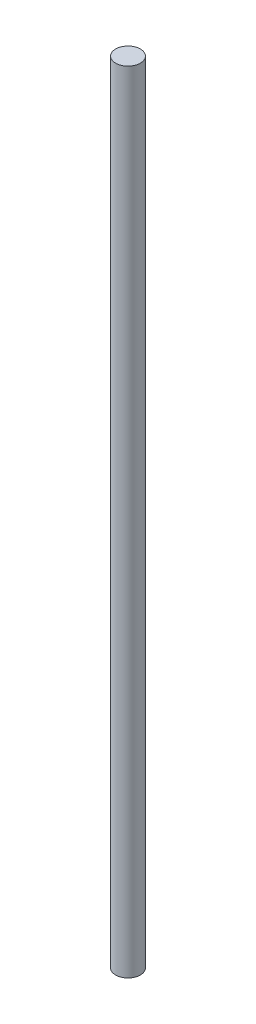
from build123d import *

# Parameters (mm, degrees)
SKETCH1_R           = 2.5
BOSS_EXTRUDE1_DEPTH = 160


with BuildPart() as part:
    # Sketch1 → Boss-Extrude1 (new body)
    with BuildSketch(Plane(origin=(0, 0, 0), x_dir=(1, 0, 0), z_dir=(0, 1, 0))):
        with Locations(Location((0, 0, 0), (0, 0, 270))):
            Circle(SKETCH1_R)
    extrude(amount=BOSS_EXTRUDE1_DEPTH)


solid = part.part
